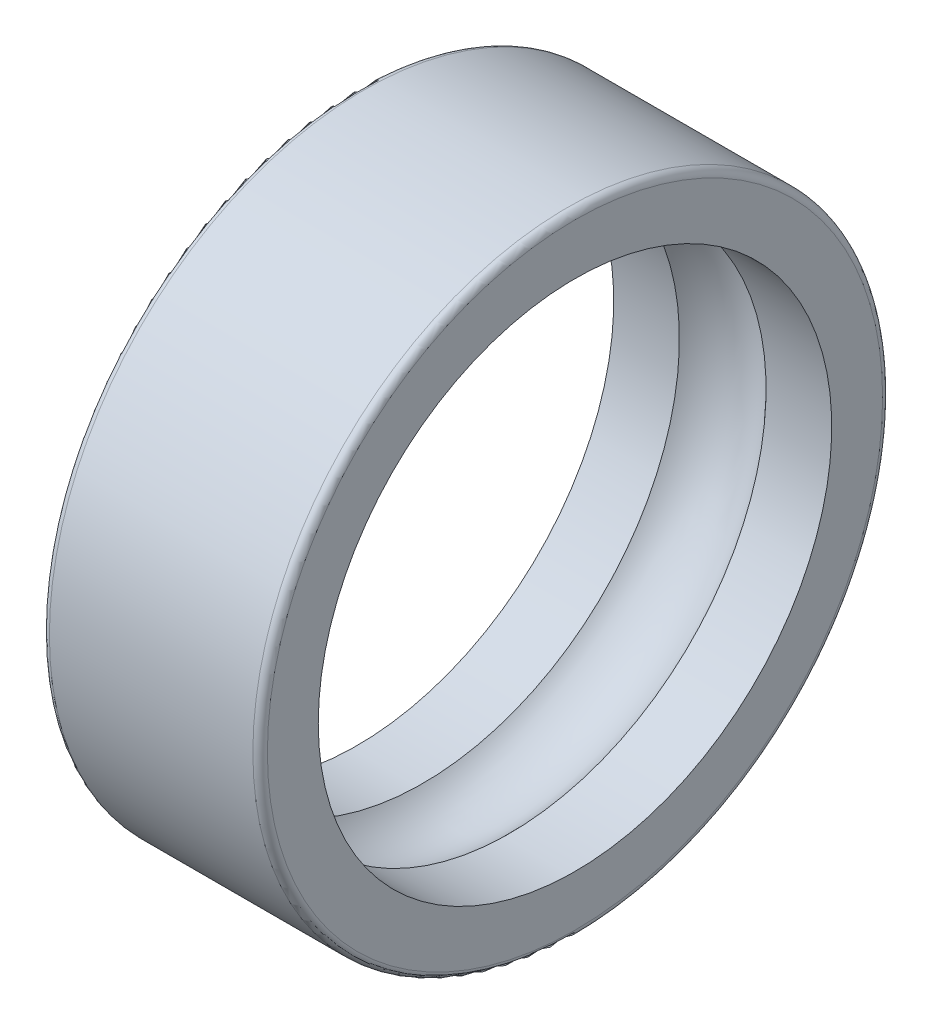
ISO-10303-21;
HEADER;
FILE_DESCRIPTION(('STEP AP214'),'2;1');
FILE_NAME('part.step','',(''),(''),'','','');
FILE_SCHEMA(('AUTOMOTIVE_DESIGN { 1 0 10303 214 1 1 1 1 }'));
ENDSEC;
DATA;
#1=APPLICATION_CONTEXT('core data for automotive mechanical design processes');
#2=APPLICATION_PROTOCOL_DEFINITION('international standard','automotive_design',2000,#1);
#3=PRODUCT_CONTEXT('',#1,'mechanical');
#4=PRODUCT('Part','Part','',(#3));
#5=PRODUCT_RELATED_PRODUCT_CATEGORY('part','',(#4));
#6=PRODUCT_DEFINITION_FORMATION('','',#4);
#7=PRODUCT_DEFINITION_CONTEXT('part definition',#1,'design');
#8=PRODUCT_DEFINITION('design','',#6,#7);
#9=PRODUCT_DEFINITION_SHAPE('','',#8);
#10=(LENGTH_UNIT() NAMED_UNIT(*) SI_UNIT(.MILLI.,.METRE.));
#11=(NAMED_UNIT(*) PLANE_ANGLE_UNIT() SI_UNIT($,.RADIAN.));
#12=(NAMED_UNIT(*) SI_UNIT($,.STERADIAN.) SOLID_ANGLE_UNIT());
#13=UNCERTAINTY_MEASURE_WITH_UNIT(LENGTH_MEASURE(1.E-05),#10,'distance_accuracy_value','');
#14=(GEOMETRIC_REPRESENTATION_CONTEXT(3) GLOBAL_UNCERTAINTY_ASSIGNED_CONTEXT((#13)) GLOBAL_UNIT_ASSIGNED_CONTEXT((#10,
#11,#12)) REPRESENTATION_CONTEXT('',''));
#15=CARTESIAN_POINT('',(0.,0.,0.));
#16=DIRECTION('',(0.,0.,1.));
#17=DIRECTION('',(1.,0.,0.));
#18=AXIS2_PLACEMENT_3D('',#15,#16,#17);
#19=CARTESIAN_POINT('',(0.300000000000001,0.,0.));
#20=DIRECTION('',(-1.,0.,0.));
#21=DIRECTION('',(0.,0.,1.));
#22=AXIS2_PLACEMENT_3D('',#19,#20,#21);
#23=TOROIDAL_SURFACE('',#22,12.7,0.3);
#24=CARTESIAN_POINT('',(0.,0.,0.));
#25=DIRECTION('',(-1.,0.,0.));
#26=DIRECTION('',(0.,0.,1.));
#27=AXIS2_PLACEMENT_3D('',#24,#25,#26);
#28=CIRCLE('',#27,12.7);
#29=CARTESIAN_POINT('',(0.,0.,12.7));
#30=VERTEX_POINT('',#29);
#31=EDGE_CURVE('E10',#30,#30,#28,.T.);
#32=ORIENTED_EDGE('',*,*,#31,.F.);
#33=EDGE_LOOP('',(#32));
#34=FACE_BOUND('',#33,.T.);
#35=CARTESIAN_POINT('',(0.300000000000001,0.,0.));
#36=DIRECTION('',(-1.,0.,0.));
#37=DIRECTION('',(0.,0.,1.));
#38=AXIS2_PLACEMENT_3D('',#35,#36,#37);
#39=CIRCLE('',#38,13.);
#40=CARTESIAN_POINT('',(0.300000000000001,0.,13.));
#41=VERTEX_POINT('',#40);
#42=EDGE_CURVE('E60',#41,#41,#39,.T.);
#43=ORIENTED_EDGE('',*,*,#42,.T.);
#44=EDGE_LOOP('',(#43));
#45=FACE_BOUND('',#44,.T.);
#46=ADVANCED_FACE('F32',(#34,#45),#23,.T.);
#47=CARTESIAN_POINT('',(0.,0.,-12.7));
#48=DIRECTION('',(1.,0.,0.));
#49=DIRECTION('',(0.,0.,-1.));
#50=AXIS2_PLACEMENT_3D('',#47,#48,#49);
#51=PLANE('',#50);
#52=CARTESIAN_POINT('',(0.,0.,0.));
#53=DIRECTION('',(-1.,0.,0.));
#54=DIRECTION('',(0.,0.,1.));
#55=AXIS2_PLACEMENT_3D('',#52,#53,#54);
#56=CIRCLE('',#55,10.6);
#57=CARTESIAN_POINT('',(0.,0.,10.6));
#58=VERTEX_POINT('',#57);
#59=EDGE_CURVE('E38',#58,#58,#56,.T.);
#60=ORIENTED_EDGE('',*,*,#59,.F.);
#61=EDGE_LOOP('',(#60));
#62=FACE_BOUND('',#61,.T.);
#63=ORIENTED_EDGE('',*,*,#31,.T.);
#64=EDGE_LOOP('',(#63));
#65=FACE_BOUND('',#64,.T.);
#66=ADVANCED_FACE('F97',(#62,#65),#51,.F.);
#67=CARTESIAN_POINT('',(0.,0.,0.));
#68=DIRECTION('',(-1.,0.,0.));
#69=DIRECTION('',(0.,0.,1.));
#70=AXIS2_PLACEMENT_3D('',#67,#68,#69);
#71=CYLINDRICAL_SURFACE('',#70,10.6);
#72=CARTESIAN_POINT('',(2.71114561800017,0.,0.));
#73=DIRECTION('',(-1.,0.,0.));
#74=DIRECTION('',(0.,0.,1.));
#75=AXIS2_PLACEMENT_3D('',#72,#73,#74);
#76=CIRCLE('',#75,10.6);
#77=CARTESIAN_POINT('',(2.71114561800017,0.,10.6));
#78=VERTEX_POINT('',#77);
#79=EDGE_CURVE('E42',#78,#78,#76,.T.);
#80=ORIENTED_EDGE('',*,*,#79,.F.);
#81=EDGE_LOOP('',(#80));
#82=FACE_BOUND('',#81,.T.);
#83=ORIENTED_EDGE('',*,*,#59,.T.);
#84=EDGE_LOOP('',(#83));
#85=FACE_BOUND('',#84,.T.);
#86=ADVANCED_FACE('F92',(#82,#85),#71,.F.);
#87=CARTESIAN_POINT('',(4.5,0.,0.));
#88=DIRECTION('',(-1.,0.,0.));
#89=DIRECTION('',(0.,0.,1.));
#90=AXIS2_PLACEMENT_3D('',#87,#88,#89);
#91=TOROIDAL_SURFACE('',#90,9.,2.4);
#92=CARTESIAN_POINT('',(6.28885438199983,0.,0.));
#93=DIRECTION('',(-1.,0.,0.));
#94=DIRECTION('',(0.,0.,1.));
#95=AXIS2_PLACEMENT_3D('',#92,#93,#94);
#96=CIRCLE('',#95,10.6);
#97=CARTESIAN_POINT('',(6.28885438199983,0.,10.6));
#98=VERTEX_POINT('',#97);
#99=EDGE_CURVE('E46',#98,#98,#96,.T.);
#100=ORIENTED_EDGE('',*,*,#99,.F.);
#101=EDGE_LOOP('',(#100));
#102=FACE_BOUND('',#101,.T.);
#103=ORIENTED_EDGE('',*,*,#79,.T.);
#104=EDGE_LOOP('',(#103));
#105=FACE_BOUND('',#104,.T.);
#106=ADVANCED_FACE('F86',(#102,#105),#91,.F.);
#107=CARTESIAN_POINT('',(0.,0.,0.));
#108=DIRECTION('',(-1.,0.,0.));
#109=DIRECTION('',(0.,0.,1.));
#110=AXIS2_PLACEMENT_3D('',#107,#108,#109);
#111=CYLINDRICAL_SURFACE('',#110,10.6);
#112=CARTESIAN_POINT('',(9.,0.,0.));
#113=DIRECTION('',(-1.,0.,0.));
#114=DIRECTION('',(0.,0.,1.));
#115=AXIS2_PLACEMENT_3D('',#112,#113,#114);
#116=CIRCLE('',#115,10.6);
#117=CARTESIAN_POINT('',(9.,0.,10.6));
#118=VERTEX_POINT('',#117);
#119=EDGE_CURVE('E51',#118,#118,#116,.T.);
#120=ORIENTED_EDGE('',*,*,#119,.F.);
#121=EDGE_LOOP('',(#120));
#122=FACE_BOUND('',#121,.T.);
#123=ORIENTED_EDGE('',*,*,#99,.T.);
#124=EDGE_LOOP('',(#123));
#125=FACE_BOUND('',#124,.T.);
#126=ADVANCED_FACE('F80',(#122,#125),#111,.F.);
#127=CARTESIAN_POINT('',(9.,0.,-12.7));
#128=DIRECTION('',(-1.,0.,0.));
#129=DIRECTION('',(0.,0.,1.));
#130=AXIS2_PLACEMENT_3D('',#127,#128,#129);
#131=PLANE('',#130);
#132=CARTESIAN_POINT('',(9.,0.,0.));
#133=DIRECTION('',(-1.,0.,0.));
#134=DIRECTION('',(0.,0.,1.));
#135=AXIS2_PLACEMENT_3D('',#132,#133,#134);
#136=CIRCLE('',#135,12.7);
#137=CARTESIAN_POINT('',(9.,0.,12.7));
#138=VERTEX_POINT('',#137);
#139=EDGE_CURVE('E54',#138,#138,#136,.T.);
#140=ORIENTED_EDGE('',*,*,#139,.F.);
#141=EDGE_LOOP('',(#140));
#142=FACE_BOUND('',#141,.T.);
#143=ORIENTED_EDGE('',*,*,#119,.T.);
#144=EDGE_LOOP('',(#143));
#145=FACE_BOUND('',#144,.T.);
#146=ADVANCED_FACE('F74',(#142,#145),#131,.F.);
#147=CARTESIAN_POINT('',(8.7,0.,0.));
#148=DIRECTION('',(-1.,0.,0.));
#149=DIRECTION('',(0.,0.,1.));
#150=AXIS2_PLACEMENT_3D('',#147,#148,#149);
#151=TOROIDAL_SURFACE('',#150,12.7,0.3);
#152=CARTESIAN_POINT('',(8.7,0.,0.));
#153=DIRECTION('',(-1.,0.,0.));
#154=DIRECTION('',(0.,0.,1.));
#155=AXIS2_PLACEMENT_3D('',#152,#153,#154);
#156=CIRCLE('',#155,13.);
#157=CARTESIAN_POINT('',(8.7,0.,13.));
#158=VERTEX_POINT('',#157);
#159=EDGE_CURVE('E57',#158,#158,#156,.T.);
#160=ORIENTED_EDGE('',*,*,#159,.F.);
#161=EDGE_LOOP('',(#160));
#162=FACE_BOUND('',#161,.T.);
#163=ORIENTED_EDGE('',*,*,#139,.T.);
#164=EDGE_LOOP('',(#163));
#165=FACE_BOUND('',#164,.T.);
#166=ADVANCED_FACE('F68',(#162,#165),#151,.T.);
#167=CARTESIAN_POINT('',(0.,0.,0.));
#168=DIRECTION('',(-1.,0.,0.));
#169=DIRECTION('',(0.,0.,1.));
#170=AXIS2_PLACEMENT_3D('',#167,#168,#169);
#171=CYLINDRICAL_SURFACE('',#170,13.);
#172=ORIENTED_EDGE('',*,*,#42,.F.);
#173=EDGE_LOOP('',(#172));
#174=FACE_BOUND('',#173,.T.);
#175=ORIENTED_EDGE('',*,*,#159,.T.);
#176=EDGE_LOOP('',(#175));
#177=FACE_BOUND('',#176,.T.);
#178=ADVANCED_FACE('F65',(#174,#177),#171,.T.);
#179=CLOSED_SHELL('',(#46,#66,#86,#106,#126,#146,#166,#178));
#180=MANIFOLD_SOLID_BREP('B2',#179);
#181=ADVANCED_BREP_SHAPE_REPRESENTATION('',(#18,#180),#14);
#182=SHAPE_DEFINITION_REPRESENTATION(#9,#181);
ENDSEC;
END-ISO-10303-21;
